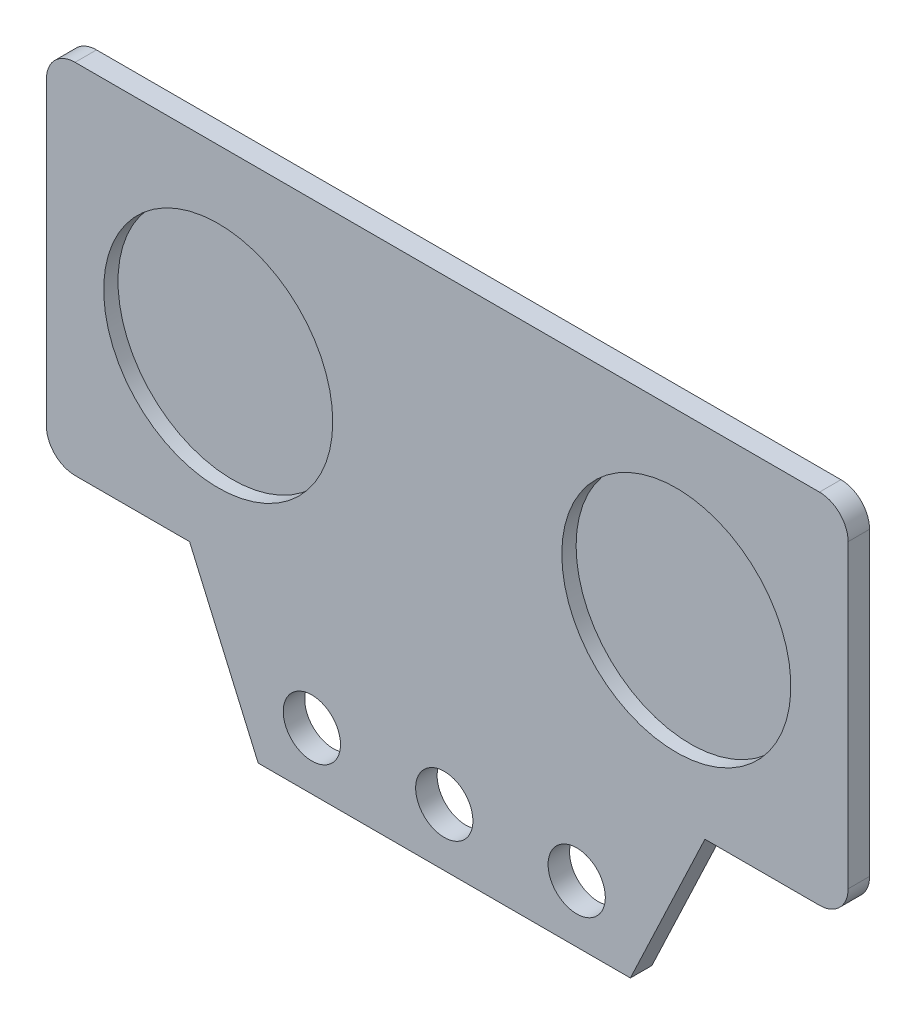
from build123d import *

# Parameters (mm, degrees)
ESQUISSE1_R             = 2
BOSS_EXTRU_1_DEPTH      = 1.5
ESQUISSE2_R             = 8
ENL_V_MAT_EXTRU_1_DEPTH = 1


with BuildPart() as part:
    # Esquisse1 → Boss.-Extru.1 (new body)
    with BuildSketch(Plane.XY):
        with BuildLine():
            Line((0, 2), (0, 23))
            ThreePointArc((0, 23), (0.585786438, 24.414213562), (2, 25))
            Line((2, 25), (54, 25))
            ThreePointArc((54, 25), (55.414213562, 24.414213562), (56, 23))
            Line((56, 23), (56, 2))
            ThreePointArc((56, 2), (55.414213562, 0.585786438), (54, 0))
            Line((54, 0), (46, 0))
            Line((46, 0), (40.791629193, -11))
            Line((40.791629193, -11), (14.791629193, -11))
            Line((14.791629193, -11), (10, 0))
            Line((10, 0), (2, 0))
            ThreePointArc((2, 0), (0.585786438, 0.585786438), (0, 2))
        make_face()
        with Locations((18.541629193, -7)):
            Circle(ESQUISSE1_R, mode=Mode.SUBTRACT)
        with Locations((37.041629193, -7)):
            Circle(ESQUISSE1_R, mode=Mode.SUBTRACT)
        with Locations((27.791629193, -7)):
            Circle(ESQUISSE1_R, mode=Mode.SUBTRACT)
    extrude(amount=BOSS_EXTRU_1_DEPTH)

    # Esquisse2 → Enl_v. mat.-Extru.1 (cut)
    with BuildSketch(Plane.XY.offset(1.5)):
        with Locations((12, 12.250901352)):
            Circle(ESQUISSE2_R)
        with Locations(Location((44, 12.250901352, 0), (0, 0, 180))):
            Circle(ESQUISSE2_R)
    extrude(amount=-ENL_V_MAT_EXTRU_1_DEPTH, mode=Mode.SUBTRACT)


solid = part.part
